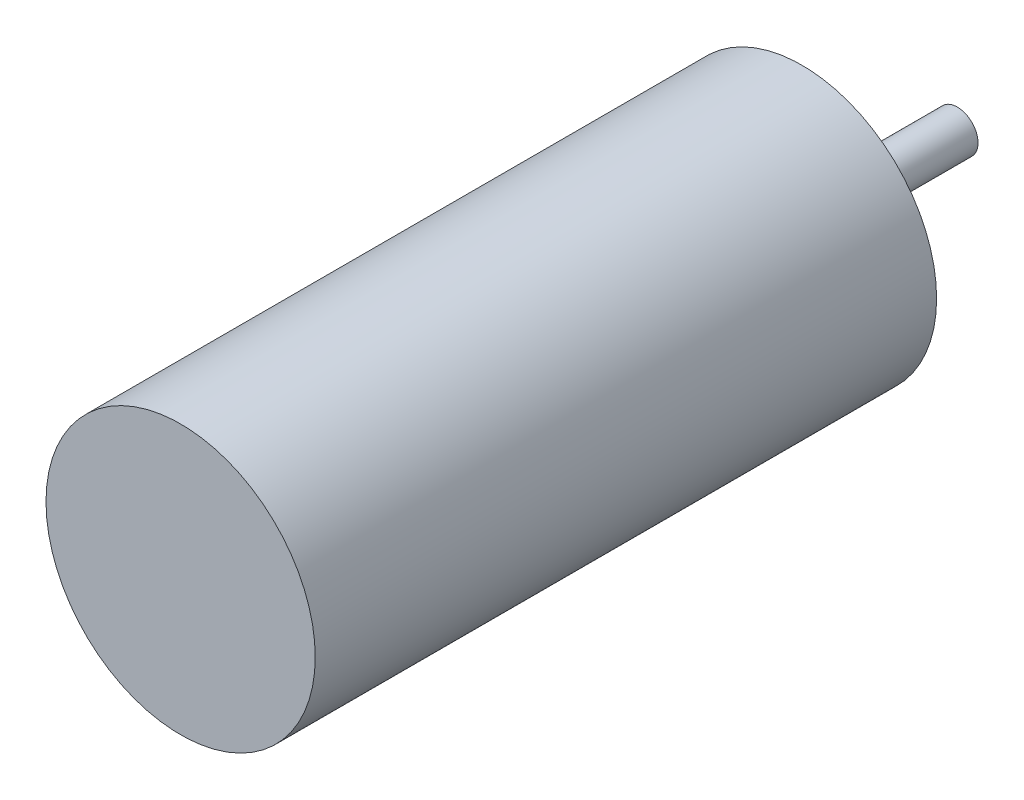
from build123d import *

# Parameters (mm, degrees)
CROQUIS1_R              = 13
SALIENTE_EXTRUIR1_DEPTH = 60
CROQUIS2_R              = 2
SALIENTE_EXTRUIR2_DEPTH = 15
CROQUIS3_R              = 1.5
CORTAR_EXTRUIR1_DEPTH   = 7


with BuildPart() as part:
    # Croquis1 → Saliente-Extruir1 (new body)
    with BuildSketch(Plane.XY):
        Circle(CROQUIS1_R)
    extrude(amount=SALIENTE_EXTRUIR1_DEPTH)

    # Croquis2 → Saliente-Extruir2 (add)
    with BuildSketch(Plane(origin=(0, 0, 0), x_dir=(-1, 0, 0), z_dir=(0, 0, -1))):
        Circle(CROQUIS2_R)
    extrude(amount=SALIENTE_EXTRUIR2_DEPTH)

    # Croquis3 → Cortar-Extruir1 (cut)
    with BuildSketch(Plane(origin=(0, 0, 0), x_dir=(-1, 0, 0), z_dir=(0, 0, -1))):
        with Locations((-9, 0)):
            Circle(CROQUIS3_R)
        with Locations((9, 0)):
            Circle(CROQUIS3_R)
    extrude(amount=-CORTAR_EXTRUIR1_DEPTH, mode=Mode.SUBTRACT)


solid = part.part
